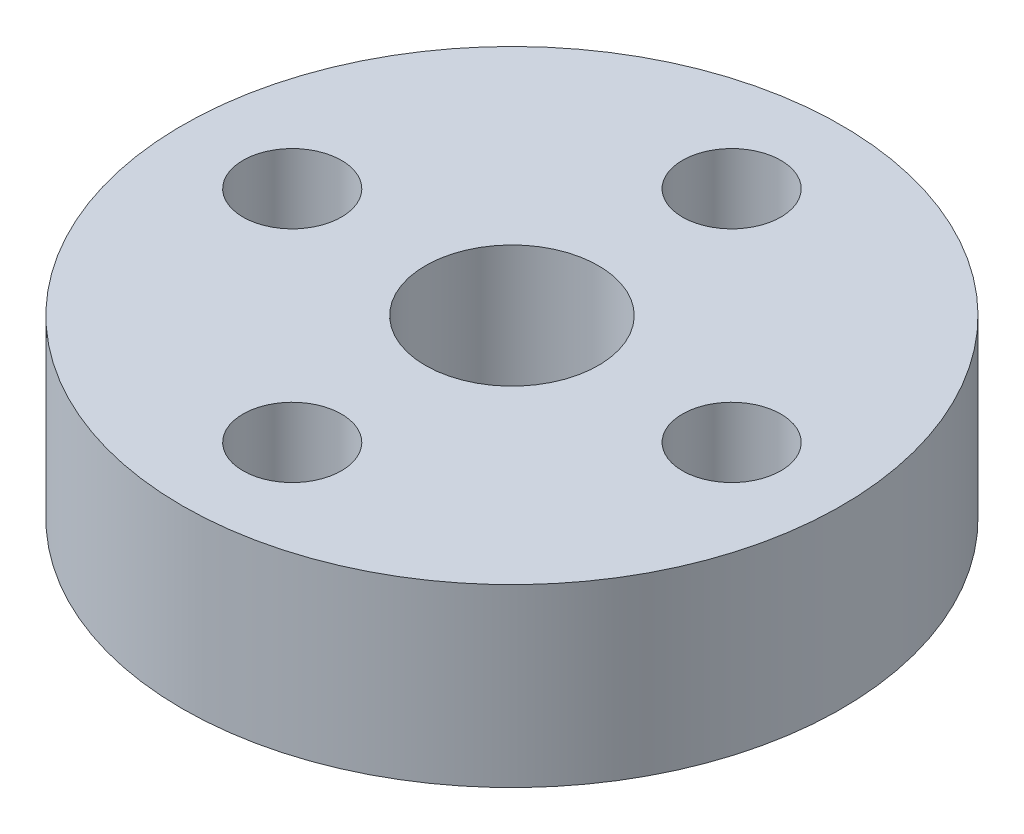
from build123d import *

# Parameters (mm, degrees)
SKETCH1_R                   = 9.525
SKETCH1_R_2                 = 2.5
BOSS_EXTRUDE1_DEPTH         = 5.08
F_34_0_111_DIAMETER_HOLE1_D = 2.8448


with BuildPart() as part:
    # Sketch1 → Boss-Extrude1 (new body)
    with BuildSketch(Plane(origin=(0, 0, 0), x_dir=(1, 0, 0), z_dir=(0, 1, 0))):
        with Locations(Location((0, 0, 0), (0, 0, 270))):
            Circle(SKETCH1_R)
        with Locations(Location((0, 0, 0), (0, 0, 270))):
            Circle(SKETCH1_R_2, mode=Mode.SUBTRACT)
    extrude(amount=BOSS_EXTRUDE1_DEPTH)

    # 34 _0.111_ Diameter Hole1 (through all)
    with Locations(Plane(origin=(0, 5.08, 0), x_dir=(1, 0, 0), z_dir=(0, 1, 0))):
        with Locations((-6.35, 0), (0, 6.35), (6.35, 0), (0, -6.35)):
            Hole(F_34_0_111_DIAMETER_HOLE1_D / 2)


solid = part.part
